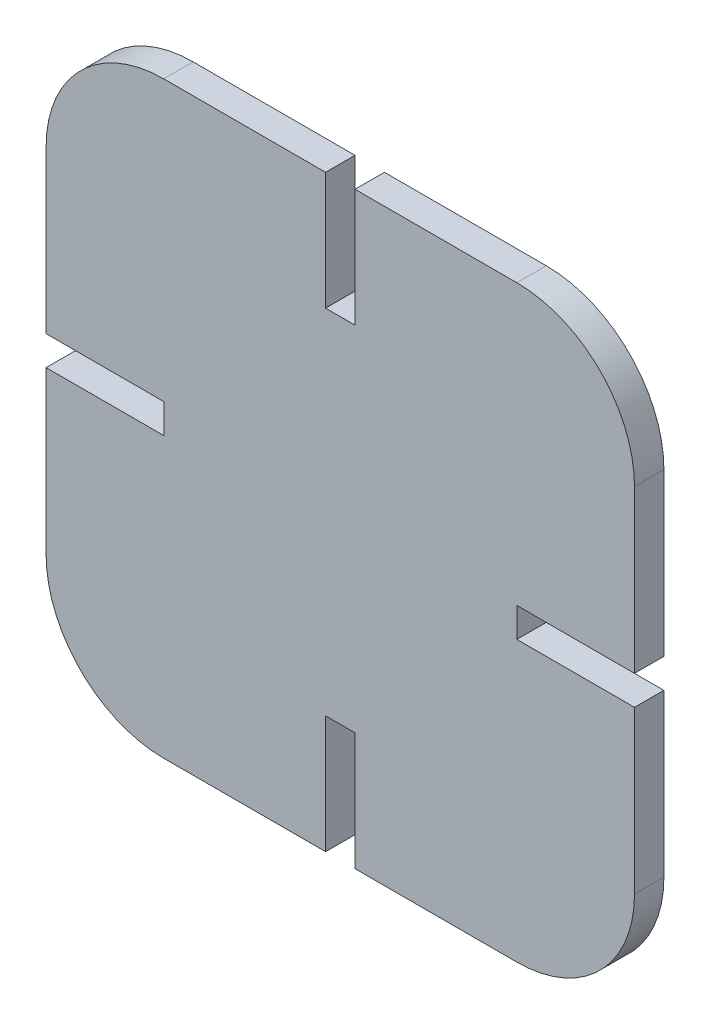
from build123d import *

# Parameters (mm, degrees)
BOSS_EXTRUDE1_DEPTH = 2.5
SKETCH2_W           = 2.5
SKETCH2_H           = 10
SKETCH2_W_2         = 10
SKETCH2_H_2         = 2.5
CUT_EXTRUDE3_DEPTH  = 2.5


with BuildPart() as part:
    # Sketch1 → Boss-Extrude1 (new body)
    with BuildSketch(Plane.XY):
        with BuildLine():
            Line((-15, 25), (15, 25))
            ThreePointArc((15, 25), (22.071067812, 22.071067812), (25, 15))
            Line((25, 15), (25, -15))
            ThreePointArc((25, -15), (22.071067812, -22.071067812), (15, -25))
            Line((15, -25), (-15, -25))
            ThreePointArc((-15, -25), (-22.071067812, -22.071067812), (-25, -15))
            Line((-25, -15), (-25, 15))
            ThreePointArc((-25, 15), (-22.071067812, 22.071067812), (-15, 25))
        make_face()
    extrude(amount=BOSS_EXTRUDE1_DEPTH)

    # Sketch2 → Cut-Extrude3 (cut)
    with BuildSketch(Plane.XY.offset(2.5)):
        with Locations((0, 20)):
            Rectangle(SKETCH2_W, SKETCH2_H)
        with Locations((20, 0)):
            Rectangle(SKETCH2_W_2, SKETCH2_H_2)
        with Locations((0, -20)):
            Rectangle(SKETCH2_W, SKETCH2_H)
        with Locations((-20, 0)):
            Rectangle(SKETCH2_W_2, SKETCH2_H_2)
    extrude(amount=-CUT_EXTRUDE3_DEPTH, mode=Mode.SUBTRACT)


solid = part.part
